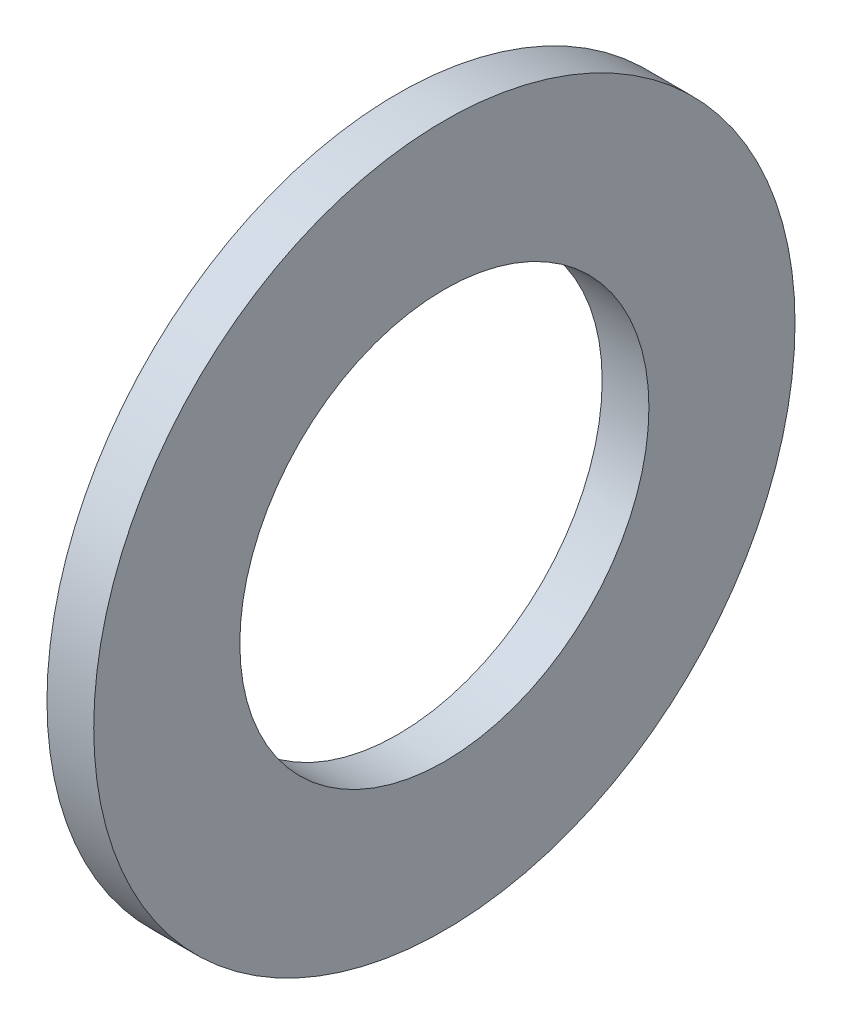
ISO-10303-21;
HEADER;
FILE_DESCRIPTION(('STEP AP214'),'2;1');
FILE_NAME('part.step','',(''),(''),'','','');
FILE_SCHEMA(('AUTOMOTIVE_DESIGN { 1 0 10303 214 1 1 1 1 }'));
ENDSEC;
DATA;
#1=APPLICATION_CONTEXT('core data for automotive mechanical design processes');
#2=APPLICATION_PROTOCOL_DEFINITION('international standard','automotive_design',2000,#1);
#3=PRODUCT_CONTEXT('',#1,'mechanical');
#4=PRODUCT('Part','Part','',(#3));
#5=PRODUCT_RELATED_PRODUCT_CATEGORY('part','',(#4));
#6=PRODUCT_DEFINITION_FORMATION('','',#4);
#7=PRODUCT_DEFINITION_CONTEXT('part definition',#1,'design');
#8=PRODUCT_DEFINITION('design','',#6,#7);
#9=PRODUCT_DEFINITION_SHAPE('','',#8);
#10=(LENGTH_UNIT() NAMED_UNIT(*) SI_UNIT(.MILLI.,.METRE.));
#11=(NAMED_UNIT(*) PLANE_ANGLE_UNIT() SI_UNIT($,.RADIAN.));
#12=(NAMED_UNIT(*) SI_UNIT($,.STERADIAN.) SOLID_ANGLE_UNIT());
#13=UNCERTAINTY_MEASURE_WITH_UNIT(LENGTH_MEASURE(1.E-05),#10,'distance_accuracy_value','');
#14=(GEOMETRIC_REPRESENTATION_CONTEXT(3) GLOBAL_UNCERTAINTY_ASSIGNED_CONTEXT((#13)) GLOBAL_UNIT_ASSIGNED_CONTEXT((#10,
#11,#12)) REPRESENTATION_CONTEXT('',''));
#15=CARTESIAN_POINT('',(0.,0.,0.));
#16=DIRECTION('',(0.,0.,1.));
#17=DIRECTION('',(1.,0.,0.));
#18=AXIS2_PLACEMENT_3D('',#15,#16,#17);
#19=CARTESIAN_POINT('',(0.,3.,0.));
#20=DIRECTION('',(1.,0.,0.));
#21=DIRECTION('',(0.,0.,-1.));
#22=AXIS2_PLACEMENT_3D('',#19,#20,#21);
#23=PLANE('',#22);
#24=CARTESIAN_POINT('',(0.,0.,0.));
#25=DIRECTION('',(-1.,0.,0.));
#26=DIRECTION('',(0.,0.,1.));
#27=AXIS2_PLACEMENT_3D('',#24,#25,#26);
#28=CIRCLE('',#27,1.75);
#29=CARTESIAN_POINT('',(0.,0.,1.75));
#30=VERTEX_POINT('',#29);
#31=EDGE_CURVE('E10',#30,#30,#28,.T.);
#32=ORIENTED_EDGE('',*,*,#31,.F.);
#33=EDGE_LOOP('',(#32));
#34=FACE_BOUND('',#33,.T.);
#35=CARTESIAN_POINT('',(0.,0.,0.));
#36=DIRECTION('',(-1.,0.,0.));
#37=DIRECTION('',(0.,0.,1.));
#38=AXIS2_PLACEMENT_3D('',#35,#36,#37);
#39=CIRCLE('',#38,3.);
#40=CARTESIAN_POINT('',(0.,0.,3.));
#41=VERTEX_POINT('',#40);
#42=EDGE_CURVE('E41',#41,#41,#39,.T.);
#43=ORIENTED_EDGE('',*,*,#42,.T.);
#44=EDGE_LOOP('',(#43));
#45=FACE_BOUND('',#44,.T.);
#46=ADVANCED_FACE('F27',(#34,#45),#23,.F.);
#47=CARTESIAN_POINT('',(0.,0.,0.));
#48=DIRECTION('',(-1.,0.,0.));
#49=DIRECTION('',(0.,0.,1.));
#50=AXIS2_PLACEMENT_3D('',#47,#48,#49);
#51=CYLINDRICAL_SURFACE('',#50,1.75);
#52=CARTESIAN_POINT('',(0.4,0.,0.));
#53=DIRECTION('',(-1.,0.,0.));
#54=DIRECTION('',(0.,0.,1.));
#55=AXIS2_PLACEMENT_3D('',#52,#53,#54);
#56=CIRCLE('',#55,1.75);
#57=CARTESIAN_POINT('',(0.4,0.,1.75));
#58=VERTEX_POINT('',#57);
#59=EDGE_CURVE('E33',#58,#58,#56,.T.);
#60=ORIENTED_EDGE('',*,*,#59,.F.);
#61=EDGE_LOOP('',(#60));
#62=FACE_BOUND('',#61,.T.);
#63=ORIENTED_EDGE('',*,*,#31,.T.);
#64=EDGE_LOOP('',(#63));
#65=FACE_BOUND('',#64,.T.);
#66=ADVANCED_FACE('F56',(#62,#65),#51,.F.);
#67=CARTESIAN_POINT('',(0.4,3.,0.));
#68=DIRECTION('',(-1.,0.,0.));
#69=DIRECTION('',(0.,0.,1.));
#70=AXIS2_PLACEMENT_3D('',#67,#68,#69);
#71=PLANE('',#70);
#72=CARTESIAN_POINT('',(0.4,0.,0.));
#73=DIRECTION('',(-1.,0.,0.));
#74=DIRECTION('',(0.,0.,1.));
#75=AXIS2_PLACEMENT_3D('',#72,#73,#74);
#76=CIRCLE('',#75,3.);
#77=CARTESIAN_POINT('',(0.4,0.,3.));
#78=VERTEX_POINT('',#77);
#79=EDGE_CURVE('E37',#78,#78,#76,.T.);
#80=ORIENTED_EDGE('',*,*,#79,.F.);
#81=EDGE_LOOP('',(#80));
#82=FACE_BOUND('',#81,.T.);
#83=ORIENTED_EDGE('',*,*,#59,.T.);
#84=EDGE_LOOP('',(#83));
#85=FACE_BOUND('',#84,.T.);
#86=ADVANCED_FACE('F51',(#82,#85),#71,.F.);
#87=CARTESIAN_POINT('',(0.,0.,0.));
#88=DIRECTION('',(-1.,0.,0.));
#89=DIRECTION('',(0.,0.,1.));
#90=AXIS2_PLACEMENT_3D('',#87,#88,#89);
#91=CYLINDRICAL_SURFACE('',#90,3.);
#92=ORIENTED_EDGE('',*,*,#42,.F.);
#93=EDGE_LOOP('',(#92));
#94=FACE_BOUND('',#93,.T.);
#95=ORIENTED_EDGE('',*,*,#79,.T.);
#96=EDGE_LOOP('',(#95));
#97=FACE_BOUND('',#96,.T.);
#98=ADVANCED_FACE('F48',(#94,#97),#91,.T.);
#99=CLOSED_SHELL('',(#46,#66,#86,#98));
#100=MANIFOLD_SOLID_BREP('B2',#99);
#101=ADVANCED_BREP_SHAPE_REPRESENTATION('',(#18,#100),#14);
#102=SHAPE_DEFINITION_REPRESENTATION(#9,#101);
ENDSEC;
END-ISO-10303-21;
